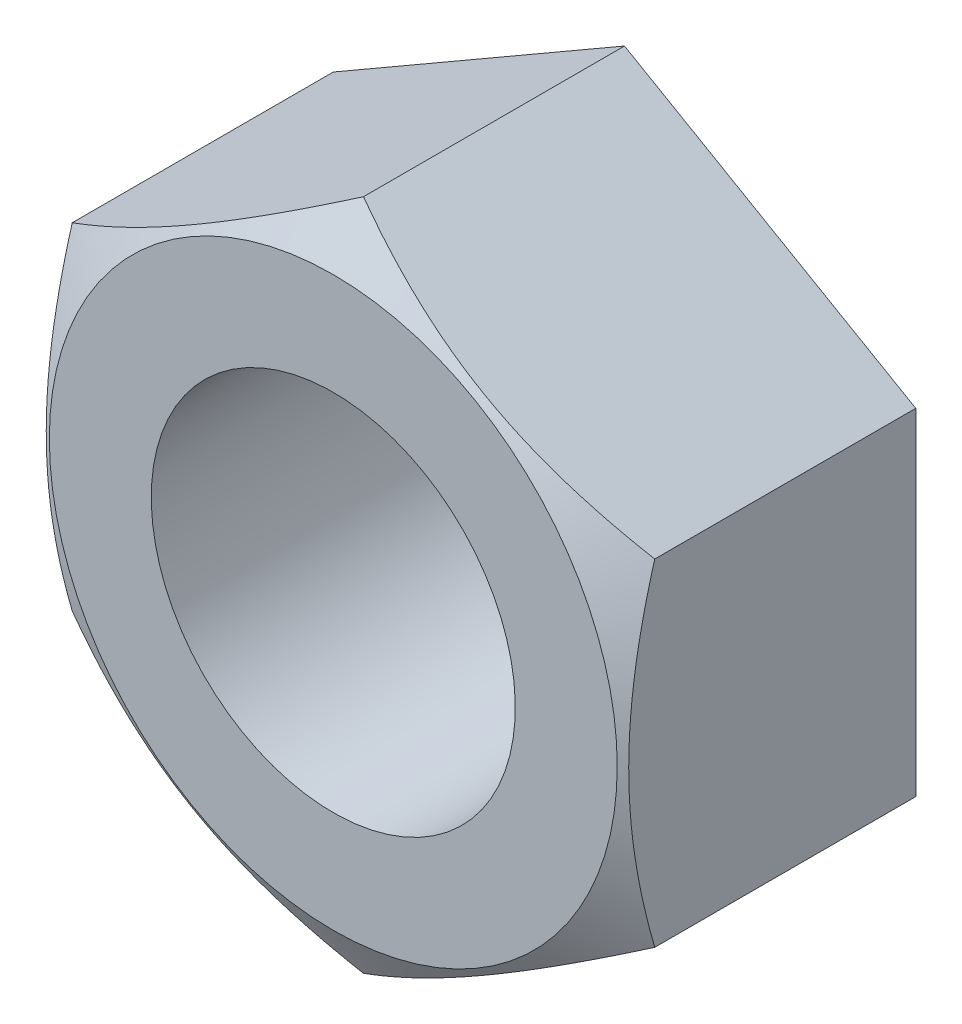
ISO-10303-21;
HEADER;
FILE_DESCRIPTION(('STEP AP214'),'2;1');
FILE_NAME('part.step','',(''),(''),'','','');
FILE_SCHEMA(('AUTOMOTIVE_DESIGN { 1 0 10303 214 1 1 1 1 }'));
ENDSEC;
DATA;
#1=APPLICATION_CONTEXT('core data for automotive mechanical design processes');
#2=APPLICATION_PROTOCOL_DEFINITION('international standard','automotive_design',2000,#1);
#3=PRODUCT_CONTEXT('',#1,'mechanical');
#4=PRODUCT('Part','Part','',(#3));
#5=PRODUCT_RELATED_PRODUCT_CATEGORY('part','',(#4));
#6=PRODUCT_DEFINITION_FORMATION('','',#4);
#7=PRODUCT_DEFINITION_CONTEXT('part definition',#1,'design');
#8=PRODUCT_DEFINITION('design','',#6,#7);
#9=PRODUCT_DEFINITION_SHAPE('','',#8);
#10=(LENGTH_UNIT() NAMED_UNIT(*) SI_UNIT(.MILLI.,.METRE.));
#11=(NAMED_UNIT(*) PLANE_ANGLE_UNIT() SI_UNIT($,.RADIAN.));
#12=(NAMED_UNIT(*) SI_UNIT($,.STERADIAN.) SOLID_ANGLE_UNIT());
#13=UNCERTAINTY_MEASURE_WITH_UNIT(LENGTH_MEASURE(1.E-05),#10,'distance_accuracy_value','');
#14=(GEOMETRIC_REPRESENTATION_CONTEXT(3) GLOBAL_UNCERTAINTY_ASSIGNED_CONTEXT((#13)) GLOBAL_UNIT_ASSIGNED_CONTEXT((#10,
#11,#12)) REPRESENTATION_CONTEXT('',''));
#15=CARTESIAN_POINT('',(0.,0.,0.));
#16=DIRECTION('',(0.,0.,1.));
#17=DIRECTION('',(1.,0.,0.));
#18=AXIS2_PLACEMENT_3D('',#15,#16,#17);
#19=CARTESIAN_POINT('',(0.,4.61880215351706,4.));
#20=DIRECTION('',(0.5,0.866025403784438,0.));
#21=DIRECTION('',(0.,0.,1.));
#22=AXIS2_PLACEMENT_3D('',#19,#20,#21);
#23=PLANE('',#22);
#24=DIRECTION('',(0.,0.,-1.));
#25=VECTOR('',#24,1.);
#26=CARTESIAN_POINT('',(0.,4.61880215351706,4.));
#27=LINE('',#26,#25);
#28=CARTESIAN_POINT('',(0.,4.61880215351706,3.58499938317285));
#29=VERTEX_POINT('',#28);
#30=CARTESIAN_POINT('',(0.,4.61880215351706,0.));
#31=VERTEX_POINT('',#30);
#32=EDGE_CURVE('E9',#29,#31,#27,.T.);
#33=ORIENTED_EDGE('',*,*,#32,.F.);
#34=CARTESIAN_POINT('',(-0.000199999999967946,4.6189176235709,3.58493271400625));
#35=CARTESIAN_POINT('',(0.175579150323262,4.51743148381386,3.64354709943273));
#36=CARTESIAN_POINT('',(0.352875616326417,4.41506932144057,3.69685465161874));
#37=CARTESIAN_POINT('',(0.710538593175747,4.20857250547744,3.7899033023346));
#38=CARTESIAN_POINT('',(0.890911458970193,4.10443418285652,3.8296114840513));
#39=CARTESIAN_POINT('',(1.24942181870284,3.8974481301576,3.89142275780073));
#40=CARTESIAN_POINT('',(1.42750415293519,3.79463224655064,3.91393724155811));
#41=CARTESIAN_POINT('',(1.78450671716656,3.58851671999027,3.94081434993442));
#42=CARTESIAN_POINT('',(1.96342564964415,3.48521782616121,3.94519923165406));
#43=CARTESIAN_POINT('',(2.29774284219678,3.29219970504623,3.93607490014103));
#44=CARTESIAN_POINT('',(2.45319115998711,3.20245157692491,3.92480601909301));
#45=CARTESIAN_POINT('',(2.76307505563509,3.02354002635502,3.88909098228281));
#46=CARTESIAN_POINT('',(2.91750956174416,2.93437722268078,3.86463262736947));
#47=CARTESIAN_POINT('',(3.2280323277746,2.7550968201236,3.80348890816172));
#48=CARTESIAN_POINT('',(3.38408128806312,2.66500191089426,3.76654436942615));
#49=CARTESIAN_POINT('',(3.69385183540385,2.48615580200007,3.68269490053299));
#50=CARTESIAN_POINT('',(3.84757739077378,2.39740231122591,3.63580967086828));
#51=CARTESIAN_POINT('',(4.0002,2.30928560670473,3.58493271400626));
#52=B_SPLINE_CURVE_WITH_KNOTS('',3,(#34,#35,#36,#37,#38,#39,#40,#41,#42,#43,#44,#45,#46,#47,#48,
#49,#50,#51),.UNSPECIFIED.,.F.,.F.,(4,2,2,2,2,2,2,2,4),(0.,0.634047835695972,1.26961969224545,
1.88946157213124,2.508542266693,3.04757825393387,3.58711366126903,4.13861653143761,
4.68903648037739),.UNSPECIFIED.);
#53=CARTESIAN_POINT('',(4.,2.30940107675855,3.58499938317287));
#54=VERTEX_POINT('',#53);
#55=EDGE_CURVE('E111',#29,#54,#52,.T.);
#56=ORIENTED_EDGE('',*,*,#55,.T.);
#57=DIRECTION('',(0.,0.,-1.));
#58=VECTOR('',#57,1.);
#59=CARTESIAN_POINT('',(4.,2.30940107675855,4.));
#60=LINE('',#59,#58);
#61=CARTESIAN_POINT('',(4.,2.30940107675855,0.));
#62=VERTEX_POINT('',#61);
#63=EDGE_CURVE('E39',#54,#62,#60,.T.);
#64=ORIENTED_EDGE('',*,*,#63,.T.);
#65=DIRECTION('',(0.866025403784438,-0.5,0.));
#66=VECTOR('',#65,1.);
#67=CARTESIAN_POINT('',(0.,4.61880215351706,0.));
#68=LINE('',#67,#66);
#69=EDGE_CURVE('E90',#31,#62,#68,.T.);
#70=ORIENTED_EDGE('',*,*,#69,.F.);
#71=EDGE_LOOP('',(#33,#56,#64,#70));
#72=FACE_BOUND('',#71,.T.);
#73=ADVANCED_FACE('F14',(#72),#23,.T.);
#74=CARTESIAN_POINT('',(0.,4.61880215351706,4.));
#75=DIRECTION('',(0.500000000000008,-0.866025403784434,0.));
#76=DIRECTION('',(0.866025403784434,0.500000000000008,0.));
#77=AXIS2_PLACEMENT_3D('',#74,#75,#76);
#78=PLANE('',#77);
#79=CARTESIAN_POINT('',(0.000200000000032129,4.6189176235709,3.58493271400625));
#80=CARTESIAN_POINT('',(-0.175579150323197,4.51743148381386,3.64354709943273));
#81=CARTESIAN_POINT('',(-0.35287561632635,4.41506932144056,3.69685465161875));
#82=CARTESIAN_POINT('',(-0.710538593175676,4.20857250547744,3.78990330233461));
#83=CARTESIAN_POINT('',(-0.890911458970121,4.10443418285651,3.82961148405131));
#84=CARTESIAN_POINT('',(-1.24942181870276,3.8974481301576,3.89142275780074));
#85=CARTESIAN_POINT('',(-1.42750415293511,3.79463224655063,3.91393724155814));
#86=CARTESIAN_POINT('',(-1.78450671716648,3.58851671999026,3.94081434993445));
#87=CARTESIAN_POINT('',(-1.96342564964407,3.48521782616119,3.94519923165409));
#88=CARTESIAN_POINT('',(-2.29774284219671,3.29219970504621,3.93607490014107));
#89=CARTESIAN_POINT('',(-2.45319115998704,3.20245157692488,3.92480601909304));
#90=CARTESIAN_POINT('',(-2.76307505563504,3.02354002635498,3.88909098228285));
#91=CARTESIAN_POINT('',(-2.91750956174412,2.93437722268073,3.86463262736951));
#92=CARTESIAN_POINT('',(-3.22803232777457,2.75509682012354,3.80348890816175));
#93=CARTESIAN_POINT('',(-3.38408128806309,2.6650019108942,3.76654436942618));
#94=CARTESIAN_POINT('',(-3.69385183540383,2.486155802,3.68269490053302));
#95=CARTESIAN_POINT('',(-3.84757739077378,2.39740231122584,3.6358096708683));
#96=CARTESIAN_POINT('',(-4.0002,2.30928560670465,3.58493271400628));
#97=B_SPLINE_CURVE_WITH_KNOTS('',3,(#79,#80,#81,#82,#83,#84,#85,#86,#87,#88,#89,#90,#91,#92,#93,
#94,#95,#96),.UNSPECIFIED.,.F.,.F.,(4,2,2,2,2,2,2,2,4),(0.,0.634047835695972,1.26961969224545,
1.88946157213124,2.508542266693,3.04757825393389,3.58711366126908,4.13861653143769,
4.68903648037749),.UNSPECIFIED.);
#98=CARTESIAN_POINT('',(-4.,2.30940107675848,3.58499938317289));
#99=VERTEX_POINT('',#98);
#100=EDGE_CURVE('E164',#29,#99,#97,.T.);
#101=ORIENTED_EDGE('',*,*,#100,.F.);
#102=ORIENTED_EDGE('',*,*,#32,.T.);
#103=DIRECTION('',(-0.866025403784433,-0.500000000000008,0.));
#104=VECTOR('',#103,1.);
#105=CARTESIAN_POINT('',(0.,4.61880215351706,0.));
#106=LINE('',#105,#104);
#107=CARTESIAN_POINT('',(-4.,2.30940107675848,0.));
#108=VERTEX_POINT('',#107);
#109=EDGE_CURVE('E85',#31,#108,#106,.T.);
#110=ORIENTED_EDGE('',*,*,#109,.T.);
#111=DIRECTION('',(0.,0.,-1.));
#112=VECTOR('',#111,1.);
#113=CARTESIAN_POINT('',(-4.,2.30940107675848,4.));
#114=LINE('',#113,#112);
#115=EDGE_CURVE('E23',#99,#108,#114,.T.);
#116=ORIENTED_EDGE('',*,*,#115,.F.);
#117=EDGE_LOOP('',(#101,#102,#110,#116));
#118=FACE_BOUND('',#117,.T.);
#119=ADVANCED_FACE('F16',(#118),#78,.F.);
#120=CARTESIAN_POINT('',(-4.,-2.30940107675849,4.));
#121=DIRECTION('',(-1.,0.,0.));
#122=DIRECTION('',(0.,-1.,0.));
#123=AXIS2_PLACEMENT_3D('',#120,#121,#122);
#124=PLANE('',#123);
#125=DIRECTION('',(0.,0.,-1.));
#126=VECTOR('',#125,1.);
#127=CARTESIAN_POINT('',(-4.,-2.30940107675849,4.));
#128=LINE('',#127,#126);
#129=CARTESIAN_POINT('',(-4.,-2.30940107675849,3.58499938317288));
#130=VERTEX_POINT('',#129);
#131=CARTESIAN_POINT('',(-4.,-2.30940107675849,0.));
#132=VERTEX_POINT('',#131);
#133=EDGE_CURVE('E68',#130,#132,#128,.T.);
#134=ORIENTED_EDGE('',*,*,#133,.F.);
#135=CARTESIAN_POINT('',(-4.,-6.19775382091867,1.99286526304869));
#136=CARTESIAN_POINT('',(-4.,-6.02309503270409,2.07756798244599));
#137=CARTESIAN_POINT('',(-4.00000000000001,-5.84803470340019,2.16145692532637));
#138=CARTESIAN_POINT('',(-4.00000000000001,-5.49689740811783,2.32714946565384));
#139=CARTESIAN_POINT('',(-4.00000000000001,-5.32082028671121,2.40895273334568));
#140=CARTESIAN_POINT('',(-4.00000000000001,-4.96652597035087,2.57042887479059));
#141=CARTESIAN_POINT('',(-4.00000000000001,-4.78830233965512,2.65008767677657));
#142=CARTESIAN_POINT('',(-4.00000000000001,-4.43043560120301,2.80613794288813));
#143=CARTESIAN_POINT('',(-4.,-4.25079256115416,2.88252956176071));
#144=CARTESIAN_POINT('',(-4.,-3.88402258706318,3.03356233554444));
#145=CARTESIAN_POINT('',(-4.,-3.69684009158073,3.10806930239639));
#146=CARTESIAN_POINT('',(-4.,-3.32028308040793,3.25143072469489));
#147=CARTESIAN_POINT('',(-4.,-3.13090832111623,3.32028454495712));
#148=CARTESIAN_POINT('',(-4.,-2.75002182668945,3.45052805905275));
#149=CARTESIAN_POINT('',(-4.,-2.5585153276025,3.51193291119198));
#150=CARTESIAN_POINT('',(-4.,-2.17275523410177,3.62530436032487));
#151=CARTESIAN_POINT('',(-4.,-1.97850252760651,3.67727393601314));
#152=CARTESIAN_POINT('',(-4.,-1.5882181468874,3.76900055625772));
#153=CARTESIAN_POINT('',(-4.,-1.39220229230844,3.80882366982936));
#154=CARTESIAN_POINT('',(-4.,-0.997738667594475,3.87400300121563));
#155=CARTESIAN_POINT('',(-4.,-0.799291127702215,3.89936057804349));
#156=CARTESIAN_POINT('',(-4.,-0.403545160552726,3.93325397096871));
#157=CARTESIAN_POINT('',(-3.99999999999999,-0.206265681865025,3.94200558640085));
#158=CARTESIAN_POINT('',(-4.,0.188331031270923,3.94251275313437));
#159=CARTESIAN_POINT('',(-4.,0.385648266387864,3.93426796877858));
#160=CARTESIAN_POINT('',(-4.,0.720799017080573,3.90641105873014));
#161=CARTESIAN_POINT('',(-3.99999999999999,0.85899170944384,3.89087464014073));
#162=CARTESIAN_POINT('',(-3.99999999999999,1.13435577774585,3.85243525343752));
#163=CARTESIAN_POINT('',(-3.99999999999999,1.27152701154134,3.82953127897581));
#164=CARTESIAN_POINT('',(-3.99999999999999,1.68133147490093,3.75097285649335));
#165=CARTESIAN_POINT('',(-3.99999999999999,1.95210043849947,3.68548649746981));
#166=CARTESIAN_POINT('',(-3.99999999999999,2.35696468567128,3.57205551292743));
#167=CARTESIAN_POINT('',(-3.99999999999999,2.49316181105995,3.53118671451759));
#168=CARTESIAN_POINT('',(-3.99999999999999,2.7642327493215,3.44523553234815));
#169=CARTESIAN_POINT('',(-3.99999999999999,2.89910655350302,3.40015312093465));
#170=CARTESIAN_POINT('',(-3.99999999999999,3.16757418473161,3.3064955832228));
#171=CARTESIAN_POINT('',(-3.99999999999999,3.30116842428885,3.25792162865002));
#172=CARTESIAN_POINT('',(-3.99999999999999,3.56725214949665,3.15784935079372));
#173=CARTESIAN_POINT('',(-4.,3.69974164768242,3.10635106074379));
#174=CARTESIAN_POINT('',(-4.,4.01075063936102,2.98214078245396));
#175=CARTESIAN_POINT('',(-3.99999999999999,4.18886049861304,2.90840504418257));
#176=CARTESIAN_POINT('',(-3.99999999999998,4.54357847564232,2.75739605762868));
#177=CARTESIAN_POINT('',(-3.99999999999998,4.72018650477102,2.68012260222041));
#178=CARTESIAN_POINT('',(-3.99999999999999,5.07217555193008,2.52274479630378));
#179=CARTESIAN_POINT('',(-3.99999999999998,5.24755631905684,2.44263988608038));
#180=CARTESIAN_POINT('',(-3.99999999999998,5.59726392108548,2.28015825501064));
#181=CARTESIAN_POINT('',(-3.99999999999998,5.77159073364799,2.19778148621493));
#182=CARTESIAN_POINT('',(-3.99999999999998,6.29359186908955,1.94774065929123));
#183=CARTESIAN_POINT('',(-3.99999999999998,6.63994540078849,1.77732089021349));
#184=CARTESIAN_POINT('',(-3.99999999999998,7.3301563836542,1.43150129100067));
#185=CARTESIAN_POINT('',(-3.99999999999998,7.67401374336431,1.25610127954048));
#186=CARTESIAN_POINT('',(-3.99999999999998,8.33135830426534,0.916503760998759));
#187=CARTESIAN_POINT('',(-3.99999999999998,8.64499165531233,0.752588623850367));
#188=CARTESIAN_POINT('',(-3.99999999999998,9.27108996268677,0.422519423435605));
#189=CARTESIAN_POINT('',(-3.99999999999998,9.58355487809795,0.256365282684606));
#190=CARTESIAN_POINT('',(-3.99999999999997,10.2068032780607,-0.0772407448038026));
#191=CARTESIAN_POINT('',(-3.99999999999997,10.5175890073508,-0.244688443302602));
#192=CARTESIAN_POINT('',(-3.99999999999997,11.1384123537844,-0.580925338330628));
#193=CARTESIAN_POINT('',(-3.99999999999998,11.4484500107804,-0.749714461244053));
#194=CARTESIAN_POINT('',(-4.,11.7582119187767,-0.919004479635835));
#195=B_SPLINE_CURVE_WITH_KNOTS('',3,(#135,#136,#137,#138,#139,#140,#141,#142,#143,#144,#145,
#146,#147,#148,#149,#150,#151,#152,#153,#154,#155,#156,#157,#158,#159,#160,#161,#162,#163,#164,
#165,#166,#167,#168,#169,#170,#171,#172,#173,#174,#175,#176,#177,#178,#179,#180,#181,#182,#183,
#184,#185,#186,#187,#188,#189,#190,#191,#192,#193,#194),.UNSPECIFIED.,.F.,.F.,(4,2,2,2,2,2,2,2,
2,2,2,2,2,2,2,2,2,2,2,2,2,2,2,2,2,2,2,2,2,4),(0.,0.582349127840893,1.16478976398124,
1.7504107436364,2.3360039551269,2.94033157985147,3.54472701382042,4.14787113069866,
4.75082450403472,5.35043717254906,5.94999349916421,6.54170358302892,7.13342535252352,
7.55041282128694,7.96745727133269,8.80201119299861,9.22856568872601,9.65512298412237,
10.0815377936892,10.5079477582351,11.0862048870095,11.6644959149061,12.2429019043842,
12.821320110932,13.9792810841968,15.1372842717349,16.1989250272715,17.260602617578,
18.319673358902,19.3786863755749),.UNSPECIFIED.);
#196=EDGE_CURVE('E98',#130,#99,#195,.T.);
#197=ORIENTED_EDGE('',*,*,#196,.T.);
#198=ORIENTED_EDGE('',*,*,#115,.T.);
#199=DIRECTION('',(0.,1.,0.));
#200=VECTOR('',#199,1.);
#201=CARTESIAN_POINT('',(-4.,-2.30940107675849,0.));
#202=LINE('',#201,#200);
#203=EDGE_CURVE('E83',#132,#108,#202,.T.);
#204=ORIENTED_EDGE('',*,*,#203,.F.);
#205=EDGE_LOOP('',(#134,#197,#198,#204));
#206=FACE_BOUND('',#205,.T.);
#207=ADVANCED_FACE('F95',(#206),#124,.T.);
#208=CARTESIAN_POINT('',(-4.,-2.30940107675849,4.));
#209=DIRECTION('',(0.5,0.866025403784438,0.));
#210=DIRECTION('',(-0.866025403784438,0.5,0.));
#211=AXIS2_PLACEMENT_3D('',#208,#209,#210);
#212=PLANE('',#211);
#213=CARTESIAN_POINT('',(-4.0002,-2.30928560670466,3.58493271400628));
#214=CARTESIAN_POINT('',(-3.82442084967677,-2.4107717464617,3.64354709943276));
#215=CARTESIAN_POINT('',(-3.64712438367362,-2.51313390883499,3.69685465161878));
#216=CARTESIAN_POINT('',(-3.28946140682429,-2.71963072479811,3.78990330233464));
#217=CARTESIAN_POINT('',(-3.10908854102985,-2.82376904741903,3.82961148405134));
#218=CARTESIAN_POINT('',(-2.75057818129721,-3.03075510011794,3.89142275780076));
#219=CARTESIAN_POINT('',(-2.57249584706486,-3.13357098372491,3.91393724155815));
#220=CARTESIAN_POINT('',(-2.21549328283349,-3.33968651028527,3.94081434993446));
#221=CARTESIAN_POINT('',(-2.0365743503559,-3.44298540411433,3.9451992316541));
#222=CARTESIAN_POINT('',(-1.70225715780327,-3.63600352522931,3.93607490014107));
#223=CARTESIAN_POINT('',(-1.54680884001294,-3.72575165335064,3.92480601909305));
#224=CARTESIAN_POINT('',(-1.23692494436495,-3.90466320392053,3.88909098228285));
#225=CARTESIAN_POINT('',(-1.08249043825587,-3.99382600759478,3.86463262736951));
#226=CARTESIAN_POINT('',(-0.771967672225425,-4.17310641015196,3.80348890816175));
#227=CARTESIAN_POINT('',(-0.615918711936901,-4.2632013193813,3.76654436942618));
#228=CARTESIAN_POINT('',(-0.306148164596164,-4.44204742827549,3.68269490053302));
#229=CARTESIAN_POINT('',(-0.152422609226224,-4.53080091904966,3.6358096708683));
#230=CARTESIAN_POINT('',(0.00019999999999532,-4.61891762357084,3.58493271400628));
#231=B_SPLINE_CURVE_WITH_KNOTS('',3,(#213,#214,#215,#216,#217,#218,#219,#220,#221,#222,#223,
#224,#225,#226,#227,#228,#229,#230),.UNSPECIFIED.,.F.,.F.,(4,2,2,2,2,2,2,2,4),(0.,
0.634047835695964,1.26961969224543,1.88946157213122,2.50854226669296,3.04757825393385,
3.58711366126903,4.13861653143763,4.68903648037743),.UNSPECIFIED.);
#232=CARTESIAN_POINT('',(0.,-4.61880215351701,3.58499938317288));
#233=VERTEX_POINT('',#232);
#234=EDGE_CURVE('E123',#130,#233,#231,.T.);
#235=ORIENTED_EDGE('',*,*,#234,.F.);
#236=ORIENTED_EDGE('',*,*,#133,.T.);
#237=DIRECTION('',(0.866025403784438,-0.5,0.));
#238=VECTOR('',#237,1.);
#239=CARTESIAN_POINT('',(-4.,-2.30940107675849,0.));
#240=LINE('',#239,#238);
#241=CARTESIAN_POINT('',(0.,-4.61880215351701,0.));
#242=VERTEX_POINT('',#241);
#243=EDGE_CURVE('E76',#132,#242,#240,.T.);
#244=ORIENTED_EDGE('',*,*,#243,.T.);
#245=DIRECTION('',(0.,0.,-1.));
#246=VECTOR('',#245,1.);
#247=CARTESIAN_POINT('',(0.,-4.61880215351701,4.));
#248=LINE('',#247,#246);
#249=EDGE_CURVE('E59',#233,#242,#248,.T.);
#250=ORIENTED_EDGE('',*,*,#249,.F.);
#251=EDGE_LOOP('',(#235,#236,#244,#250));
#252=FACE_BOUND('',#251,.T.);
#253=ADVANCED_FACE('F81',(#252),#212,.F.);
#254=CARTESIAN_POINT('',(0.,-4.61880215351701,4.));
#255=DIRECTION('',(-0.5,0.86602540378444,0.));
#256=DIRECTION('',(-0.86602540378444,-0.5,0.));
#257=AXIS2_PLACEMENT_3D('',#254,#255,#256);
#258=PLANE('',#257);
#259=CARTESIAN_POINT('',(-0.000200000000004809,-4.61891762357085,3.58493271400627));
#260=CARTESIAN_POINT('',(0.175579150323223,-4.51743148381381,3.64354709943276));
#261=CARTESIAN_POINT('',(0.352875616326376,-4.41506932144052,3.69685465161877));
#262=CARTESIAN_POINT('',(0.710538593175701,-4.2085725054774,3.78990330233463));
#263=CARTESIAN_POINT('',(0.890911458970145,-4.10443418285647,3.82961148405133));
#264=CARTESIAN_POINT('',(1.24942181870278,-3.89744813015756,3.89142275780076));
#265=CARTESIAN_POINT('',(1.42750415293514,-3.7946322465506,3.91393724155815));
#266=CARTESIAN_POINT('',(1.7845067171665,-3.58851671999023,3.94081434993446));
#267=CARTESIAN_POINT('',(1.9634256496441,-3.48521782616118,3.9451992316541));
#268=CARTESIAN_POINT('',(2.29774284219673,-3.29219970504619,3.93607490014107));
#269=CARTESIAN_POINT('',(2.45319115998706,-3.20245157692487,3.92480601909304));
#270=CARTESIAN_POINT('',(2.76307505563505,-3.02354002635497,3.88909098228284));
#271=CARTESIAN_POINT('',(2.91750956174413,-2.93437722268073,3.8646326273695));
#272=CARTESIAN_POINT('',(3.22803232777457,-2.75509682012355,3.80348890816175));
#273=CARTESIAN_POINT('',(3.3840812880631,-2.6650019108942,3.76654436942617));
#274=CARTESIAN_POINT('',(3.69385183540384,-2.48615580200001,3.68269490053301));
#275=CARTESIAN_POINT('',(3.84757739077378,-2.39740231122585,3.6358096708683));
#276=CARTESIAN_POINT('',(4.0002,-2.30928560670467,3.58493271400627));
#277=B_SPLINE_CURVE_WITH_KNOTS('',3,(#259,#260,#261,#262,#263,#264,#265,#266,#267,#268,#269,
#270,#271,#272,#273,#274,#275,#276),.UNSPECIFIED.,.F.,.F.,(4,2,2,2,2,2,2,2,4),(0.,
0.634047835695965,1.26961969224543,1.88946157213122,2.50854226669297,3.04757825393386,
3.58711366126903,4.13861653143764,4.68903648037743),.UNSPECIFIED.);
#278=CARTESIAN_POINT('',(4.,-2.30940107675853,3.58499938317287));
#279=VERTEX_POINT('',#278);
#280=EDGE_CURVE('E30',#233,#279,#277,.T.);
#281=ORIENTED_EDGE('',*,*,#280,.F.);
#282=ORIENTED_EDGE('',*,*,#249,.T.);
#283=DIRECTION('',(0.86602540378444,0.5,0.));
#284=VECTOR('',#283,1.);
#285=CARTESIAN_POINT('',(0.,-4.61880215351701,0.));
#286=LINE('',#285,#284);
#287=CARTESIAN_POINT('',(4.,-2.30940107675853,0.));
#288=VERTEX_POINT('',#287);
#289=EDGE_CURVE('E63',#242,#288,#286,.T.);
#290=ORIENTED_EDGE('',*,*,#289,.T.);
#291=DIRECTION('',(0.,0.,-1.));
#292=VECTOR('',#291,1.);
#293=CARTESIAN_POINT('',(4.,-2.30940107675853,4.));
#294=LINE('',#293,#292);
#295=EDGE_CURVE('E69',#279,#288,#294,.T.);
#296=ORIENTED_EDGE('',*,*,#295,.F.);
#297=EDGE_LOOP('',(#281,#282,#290,#296));
#298=FACE_BOUND('',#297,.T.);
#299=ADVANCED_FACE('F61',(#298),#258,.F.);
#300=CARTESIAN_POINT('',(4.,2.30940107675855,4.));
#301=DIRECTION('',(1.,0.,0.));
#302=DIRECTION('',(0.,1.,0.));
#303=AXIS2_PLACEMENT_3D('',#300,#301,#302);
#304=PLANE('',#303);
#305=ORIENTED_EDGE('',*,*,#63,.F.);
#306=CARTESIAN_POINT('',(3.9999999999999,-6.19775382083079,1.99286526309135));
#307=CARTESIAN_POINT('',(3.9999999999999,-6.02309503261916,2.07756798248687));
#308=CARTESIAN_POINT('',(3.9999999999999,-5.84803470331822,2.16145692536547));
#309=CARTESIAN_POINT('',(3.99999999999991,-5.49689740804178,2.32714946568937));
#310=CARTESIAN_POINT('',(3.99999999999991,-5.32082028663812,2.40895273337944));
#311=CARTESIAN_POINT('',(3.99999999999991,-4.96652597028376,2.57042887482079));
#312=CARTESIAN_POINT('',(3.99999999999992,-4.78830233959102,2.650087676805));
#313=CARTESIAN_POINT('',(3.99999999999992,-4.43043560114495,2.80613794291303));
#314=CARTESIAN_POINT('',(3.99999999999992,-4.25079256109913,2.88252956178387));
#315=CARTESIAN_POINT('',(3.99999999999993,-3.88402258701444,3.03356233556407));
#316=CARTESIAN_POINT('',(3.99999999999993,-3.69684009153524,3.10806930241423));
#317=CARTESIAN_POINT('',(3.99999999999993,-3.32028308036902,3.25143072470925));
#318=CARTESIAN_POINT('',(3.99999999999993,-3.13090832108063,3.32028454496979));
#319=CARTESIAN_POINT('',(3.99999999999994,-2.75002182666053,3.45052805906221));
#320=CARTESIAN_POINT('',(3.99999999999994,-2.55851532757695,3.51193291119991));
#321=CARTESIAN_POINT('',(3.99999999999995,-2.17275523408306,3.62530436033));
#322=CARTESIAN_POINT('',(3.99999999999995,-1.97850252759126,3.677273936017));
#323=CARTESIAN_POINT('',(3.99999999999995,-1.58821814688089,3.76900055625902));
#324=CARTESIAN_POINT('',(3.99999999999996,-1.39220229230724,3.80882366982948));
#325=CARTESIAN_POINT('',(3.99999999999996,-0.997738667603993,3.87400300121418));
#326=CARTESIAN_POINT('',(3.99999999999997,-0.799291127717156,3.89936057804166));
#327=CARTESIAN_POINT('',(3.99999999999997,-0.403545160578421,3.93325397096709));
#328=CARTESIAN_POINT('',(3.99999999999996,-0.206265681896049,3.94200558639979));
#329=CARTESIAN_POINT('',(3.99999999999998,0.188331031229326,3.94251275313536));
#330=CARTESIAN_POINT('',(4.,0.385648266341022,3.93426796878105));
#331=CARTESIAN_POINT('',(4.,0.720799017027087,3.9064110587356));
#332=CARTESIAN_POINT('',(3.99999999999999,0.858991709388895,3.89087464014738));
#333=CARTESIAN_POINT('',(3.99999999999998,1.13435577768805,3.85243525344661));
#334=CARTESIAN_POINT('',(3.99999999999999,1.27152701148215,3.82953127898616));
#335=CARTESIAN_POINT('',(4.,1.68133147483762,3.75097285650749));
#336=CARTESIAN_POINT('',(4.,1.95210043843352,3.68548649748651));
#337=CARTESIAN_POINT('',(4.,2.35696468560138,3.57205551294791));
#338=CARTESIAN_POINT('',(4.,2.49316181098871,3.53118671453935));
#339=CARTESIAN_POINT('',(4.00000000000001,2.76423274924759,3.44523553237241));
#340=CARTESIAN_POINT('',(4.00000000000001,2.89910655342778,3.40015312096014));
#341=CARTESIAN_POINT('',(4.00000000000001,3.16757418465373,3.30649558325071));
#342=CARTESIAN_POINT('',(4.00000000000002,3.30116842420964,3.25792162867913));
#343=CARTESIAN_POINT('',(4.00000000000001,3.5672521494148,3.15784935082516));
#344=CARTESIAN_POINT('',(4.,3.69974164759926,3.10635106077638));
#345=CARTESIAN_POINT('',(4.,4.01075063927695,2.98214078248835));
#346=CARTESIAN_POINT('',(4.00000000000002,4.18886049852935,2.90840504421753));
#347=CARTESIAN_POINT('',(4.00000000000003,4.54357847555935,2.75739605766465));
#348=CARTESIAN_POINT('',(4.00000000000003,4.72018650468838,2.68012260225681));
#349=CARTESIAN_POINT('',(4.00000000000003,5.07217555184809,2.52274479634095));
#350=CARTESIAN_POINT('',(4.00000000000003,5.24755631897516,2.44263988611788));
#351=CARTESIAN_POINT('',(4.00000000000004,5.59726392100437,2.28015825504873));
#352=CARTESIAN_POINT('',(4.00000000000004,5.77159073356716,2.19778148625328));
#353=CARTESIAN_POINT('',(4.00000000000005,6.29359186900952,1.94774065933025));
#354=CARTESIAN_POINT('',(4.00000000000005,6.63994540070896,1.77732089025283));
#355=CARTESIAN_POINT('',(4.00000000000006,7.33015638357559,1.43150129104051));
#356=CARTESIAN_POINT('',(4.00000000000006,7.67401374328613,1.2561012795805));
#357=CARTESIAN_POINT('',(4.00000000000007,8.33135830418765,0.916503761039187));
#358=CARTESIAN_POINT('',(4.00000000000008,8.6449916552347,0.752588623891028));
#359=CARTESIAN_POINT('',(4.00000000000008,9.27108996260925,0.422519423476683));
#360=CARTESIAN_POINT('',(4.00000000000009,9.58355487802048,0.256365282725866));
#361=CARTESIAN_POINT('',(4.0000000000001,10.2068032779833,-0.077240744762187));
#362=CARTESIAN_POINT('',(4.0000000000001,10.5175890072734,-0.244688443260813));
#363=CARTESIAN_POINT('',(4.00000000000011,11.1384123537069,-0.580925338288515));
#364=CARTESIAN_POINT('',(4.00000000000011,11.4484500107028,-0.749714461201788));
#365=CARTESIAN_POINT('',(4.00000000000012,11.7582119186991,-0.919004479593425));
#366=B_SPLINE_CURVE_WITH_KNOTS('',3,(#306,#307,#308,#309,#310,#311,#312,#313,#314,#315,#316,
#317,#318,#319,#320,#321,#322,#323,#324,#325,#326,#327,#328,#329,#330,#331,#332,#333,#334,#335,
#336,#337,#338,#339,#340,#341,#342,#343,#344,#345,#346,#347,#348,#349,#350,#351,#352,#353,#354,
#355,#356,#357,#358,#359,#360,#361,#362,#363,#364,#365),.UNSPECIFIED.,.F.,.F.,(4,2,2,2,2,2,2,2,
2,2,2,2,2,2,2,2,2,2,2,2,2,2,2,2,2,2,2,2,2,4),(0.,0.582349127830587,1.16478976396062,
1.75041074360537,2.33600395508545,2.94033157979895,3.54472701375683,4.14787113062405,
4.7508245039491,5.35043717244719,5.94999349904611,6.54170358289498,7.13342535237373,
7.55041282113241,7.96745727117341,8.80201119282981,9.22856568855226,9.65512298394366,
10.0815377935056,10.5079477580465,11.0862048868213,11.6644959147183,12.2429019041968,
12.8213201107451,13.9792810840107,15.1372842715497,16.1989250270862,17.2606026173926,
18.3196733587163,19.3786863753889),.UNSPECIFIED.);
#367=EDGE_CURVE('E119',#54,#279,#366,.F.);
#368=ORIENTED_EDGE('',*,*,#367,.T.);
#369=ORIENTED_EDGE('',*,*,#295,.T.);
#370=DIRECTION('',(0.,-1.,0.));
#371=VECTOR('',#370,1.);
#372=CARTESIAN_POINT('',(4.,2.30940107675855,0.));
#373=LINE('',#372,#371);
#374=EDGE_CURVE('E79',#62,#288,#373,.T.);
#375=ORIENTED_EDGE('',*,*,#374,.F.);
#376=EDGE_LOOP('',(#305,#368,#369,#375));
#377=FACE_BOUND('',#376,.T.);
#378=ADVANCED_FACE('F117',(#377),#304,.T.);
#379=CARTESIAN_POINT('',(4.,2.30940107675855,4.));
#380=DIRECTION('',(0.,0.,-1.));
#381=DIRECTION('',(-0.866025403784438,0.5,0.));
#382=AXIS2_PLACEMENT_3D('',#379,#380,#381);
#383=PLANE('',#382);
#384=CARTESIAN_POINT('',(0.,0.,4.));
#385=DIRECTION('',(0.,0.,-1.));
#386=DIRECTION('',(-0.866025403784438,0.5,0.));
#387=AXIS2_PLACEMENT_3D('',#384,#385,#386);
#388=CIRCLE('',#387,2.5);
#389=CARTESIAN_POINT('',(-2.1650635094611,1.25,4.));
#390=VERTEX_POINT('',#389);
#391=EDGE_CURVE('E104',#390,#390,#388,.T.);
#392=ORIENTED_EDGE('',*,*,#391,.T.);
#393=EDGE_LOOP('',(#392));
#394=FACE_BOUND('',#393,.T.);
#395=CARTESIAN_POINT('',(0.,0.,4.));
#396=DIRECTION('',(0.,0.,1.));
#397=DIRECTION('',(1.,0.,0.));
#398=AXIS2_PLACEMENT_3D('',#395,#396,#397);
#399=CIRCLE('',#398,3.9);
#400=CARTESIAN_POINT('',(3.9,0.,4.));
#401=VERTEX_POINT('',#400);
#402=EDGE_CURVE('E121',#401,#401,#399,.T.);
#403=ORIENTED_EDGE('',*,*,#402,.T.);
#404=EDGE_LOOP('',(#403));
#405=FACE_BOUND('',#404,.T.);
#406=ADVANCED_FACE('F145',(#394,#405),#383,.F.);
#407=CARTESIAN_POINT('',(4.,2.30940107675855,0.));
#408=DIRECTION('',(0.,0.,-1.));
#409=DIRECTION('',(-0.866025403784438,0.5,0.));
#410=AXIS2_PLACEMENT_3D('',#407,#408,#409);
#411=PLANE('',#410);
#412=CARTESIAN_POINT('',(0.,0.,0.));
#413=DIRECTION('',(0.,0.,-1.));
#414=DIRECTION('',(-0.866025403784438,0.5,0.));
#415=AXIS2_PLACEMENT_3D('',#412,#413,#414);
#416=CIRCLE('',#415,2.5);
#417=CARTESIAN_POINT('',(-2.1650635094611,1.25,0.));
#418=VERTEX_POINT('',#417);
#419=EDGE_CURVE('E106',#418,#418,#416,.T.);
#420=ORIENTED_EDGE('',*,*,#419,.F.);
#421=EDGE_LOOP('',(#420));
#422=FACE_BOUND('',#421,.T.);
#423=ORIENTED_EDGE('',*,*,#69,.T.);
#424=ORIENTED_EDGE('',*,*,#374,.T.);
#425=ORIENTED_EDGE('',*,*,#289,.F.);
#426=ORIENTED_EDGE('',*,*,#243,.F.);
#427=ORIENTED_EDGE('',*,*,#203,.T.);
#428=ORIENTED_EDGE('',*,*,#109,.F.);
#429=EDGE_LOOP('',(#423,#424,#425,#426,#427,#428));
#430=FACE_BOUND('',#429,.T.);
#431=ADVANCED_FACE('F74',(#422,#430),#411,.T.);
#432=CARTESIAN_POINT('',(0.,0.,4.));
#433=DIRECTION('',(0.,0.,-1.));
#434=DIRECTION('',(-0.866025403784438,0.5,0.));
#435=AXIS2_PLACEMENT_3D('',#432,#433,#434);
#436=CYLINDRICAL_SURFACE('',#435,2.5);
#437=ORIENTED_EDGE('',*,*,#391,.F.);
#438=EDGE_LOOP('',(#437));
#439=FACE_BOUND('',#438,.T.);
#440=ORIENTED_EDGE('',*,*,#419,.T.);
#441=EDGE_LOOP('',(#440));
#442=FACE_BOUND('',#441,.T.);
#443=ADVANCED_FACE('F180',(#439,#442),#436,.F.);
#444=CARTESIAN_POINT('',(0.,0.,4.));
#445=DIRECTION('',(0.,0.,-1.));
#446=DIRECTION('',(-1.,0.,0.));
#447=AXIS2_PLACEMENT_3D('',#444,#445,#446);
#448=CONICAL_SURFACE('',#447,3.9,1.0471975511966);
#449=ORIENTED_EDGE('',*,*,#100,.T.);
#450=ORIENTED_EDGE('',*,*,#196,.F.);
#451=ORIENTED_EDGE('',*,*,#234,.T.);
#452=ORIENTED_EDGE('',*,*,#280,.T.);
#453=ORIENTED_EDGE('',*,*,#367,.F.);
#454=ORIENTED_EDGE('',*,*,#55,.F.);
#455=EDGE_LOOP('',(#449,#450,#451,#452,#453,#454));
#456=FACE_BOUND('',#455,.T.);
#457=ORIENTED_EDGE('',*,*,#402,.F.);
#458=EDGE_LOOP('',(#457));
#459=FACE_BOUND('',#458,.T.);
#460=ADVANCED_FACE('F139',(#456,#459),#448,.T.);
#461=CLOSED_SHELL('',(#73,#119,#207,#253,#299,#378,#406,#431,#443,#460));
#462=MANIFOLD_SOLID_BREP('B1',#461);
#463=ADVANCED_BREP_SHAPE_REPRESENTATION('',(#18,#462),#14);
#464=SHAPE_DEFINITION_REPRESENTATION(#9,#463);
ENDSEC;
END-ISO-10303-21;
